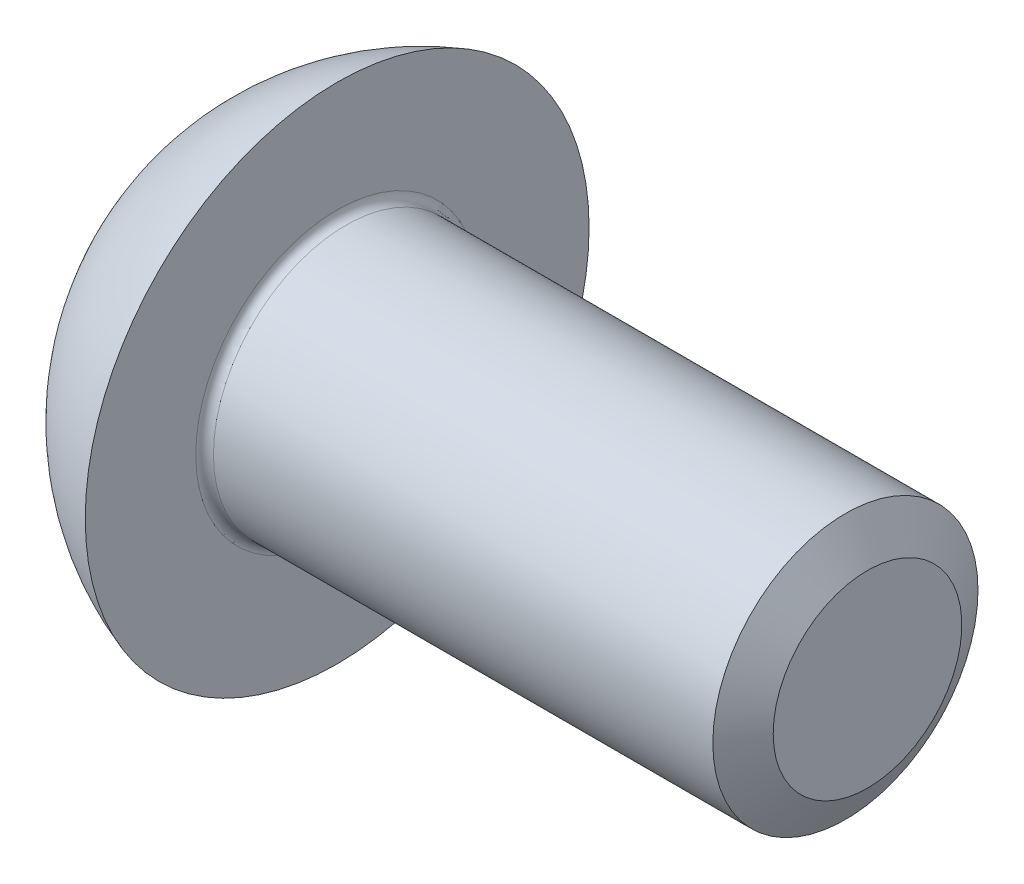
from build123d import *

# Parameters (mm, degrees)
CUT_EXTRUDE_1_DEPTH = 1.65


with BuildPart() as part:
    # Sketch 1 → Revolve 1 (revolve)
    with BuildSketch(Plane.XY, mode=Mode.PRIVATE) as revolve_1_sk:
        with BuildLine():
            Line((0, 1.5), (-5.9, 1.5))
            ThreePointArc((-5.9, 1.5), (-5.970710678, 1.529289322), (-6, 1.6))
            Line((-6, 1.6), (-6, 2.85))
            ThreePointArc((-6, 2.85), (-6.948716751, 2.326209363), (-7.65, 1.5))
            Line((-7.65, 1.5), (-7.65, 0))
            Line((-7.65, 0), (0, 0))
            Line((0, 0), (0, 1.5))
        make_face()
    revolve(revolve_1_sk.sketch.rotate(Axis((-7.65, 0, 0), (1, 0, 0)), 90), axis=Axis((-7.65, 0, 0), (1, 0, 0)))

    # Sketch 2 → Cut-Extrude 1 (cut)
    with BuildSketch(Plane.ZY.offset(7.65)):
        Polygon((0, 1.154700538), (-1, 0.577350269), (-1, -0.577350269), (0, -1.154700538), (1, -0.577350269), (1, 0.577350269), align=None)
    extrude(amount=-CUT_EXTRUDE_1_DEPTH, mode=Mode.SUBTRACT)

    # Sketch 6 → Revolve 2 (revolve)
    with BuildSketch(Plane.XY):
        Polygon((-6.61, 1.154700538), (-6, 0), (-5.7, 0), (-5.7, 1.154700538), align=None)
    revolve(axis=Axis((-7.65, 0, 0), (1, 0, 0)))

    # Sketch 7 → Cut-Revolve 5 (revolve, cut)
    with BuildSketch(Plane.XY):
        Polygon((-7.65, 1.154700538), (-7.35, 0), (-7.65, 0), align=None)
    revolve(axis=Axis((-7.65, 0, 0), (1, 0, 0)), mode=Mode.SUBTRACT)

    # Sketch 4 → Cut-Revolve 1 (revolve, cut)
    with BuildSketch(Plane.XY, mode=Mode.PRIVATE) as cut_revolve_1_sk:
        Polygon((-0.25, 1.5), (0, 1.066987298), (0.25, 1.5), align=None)
    revolve(cut_revolve_1_sk.sketch.rotate(Axis((-0.25, 0, 0), (1, 0, 0)), 90), axis=Axis((-0.25, 0, 0), (1, 0, 0)), mode=Mode.SUBTRACT)


solid = part.part
